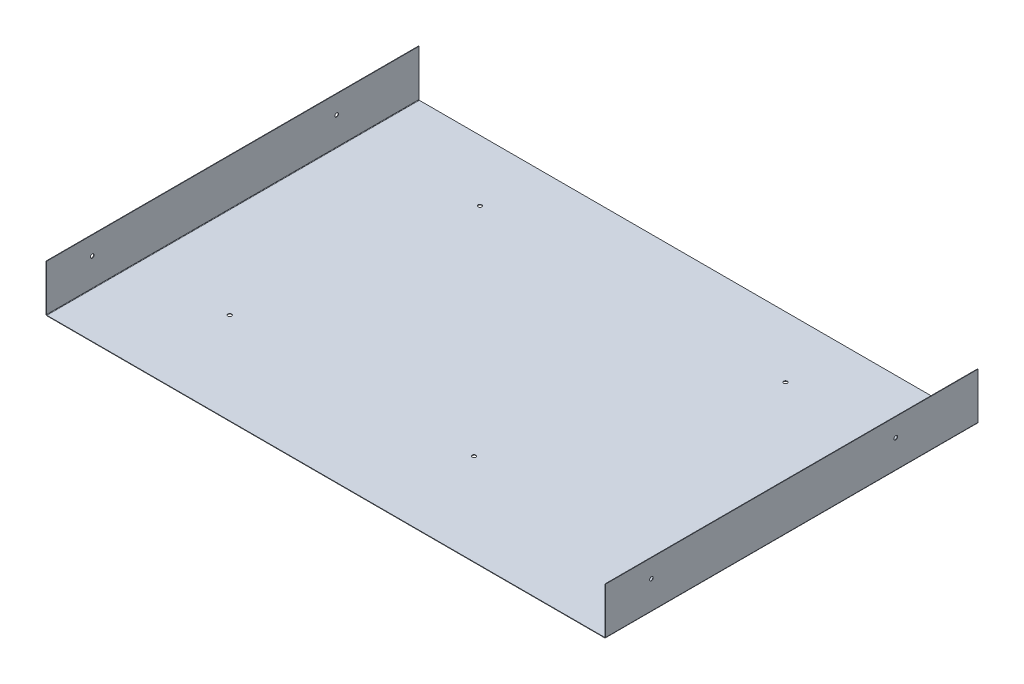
ISO-10303-21;
HEADER;
FILE_DESCRIPTION(('STEP AP214'),'2;1');
FILE_NAME('part.step','',(''),(''),'','','');
FILE_SCHEMA(('AUTOMOTIVE_DESIGN { 1 0 10303 214 1 1 1 1 }'));
ENDSEC;
DATA;
#1=APPLICATION_CONTEXT('core data for automotive mechanical design processes');
#2=APPLICATION_PROTOCOL_DEFINITION('international standard','automotive_design',2000,#1);
#3=PRODUCT_CONTEXT('',#1,'mechanical');
#4=PRODUCT('Part','Part','',(#3));
#5=PRODUCT_RELATED_PRODUCT_CATEGORY('part','',(#4));
#6=PRODUCT_DEFINITION_FORMATION('','',#4);
#7=PRODUCT_DEFINITION_CONTEXT('part definition',#1,'design');
#8=PRODUCT_DEFINITION('design','',#6,#7);
#9=PRODUCT_DEFINITION_SHAPE('','',#8);
#10=(LENGTH_UNIT() NAMED_UNIT(*) SI_UNIT(.MILLI.,.METRE.));
#11=(NAMED_UNIT(*) PLANE_ANGLE_UNIT() SI_UNIT($,.RADIAN.));
#12=(NAMED_UNIT(*) SI_UNIT($,.STERADIAN.) SOLID_ANGLE_UNIT());
#13=UNCERTAINTY_MEASURE_WITH_UNIT(LENGTH_MEASURE(1.E-05),#10,'distance_accuracy_value','');
#14=(GEOMETRIC_REPRESENTATION_CONTEXT(3) GLOBAL_UNCERTAINTY_ASSIGNED_CONTEXT((#13)) GLOBAL_UNIT_ASSIGNED_CONTEXT((#10,
#11,#12)) REPRESENTATION_CONTEXT('',''));
#15=CARTESIAN_POINT('',(0.,0.,0.));
#16=DIRECTION('',(0.,0.,1.));
#17=DIRECTION('',(1.,0.,0.));
#18=AXIS2_PLACEMENT_3D('',#15,#16,#17);
#19=CARTESIAN_POINT('',(0.7366,0.,609.6));
#20=DIRECTION('',(0.,0.,1.));
#21=DIRECTION('',(1.,0.,0.));
#22=AXIS2_PLACEMENT_3D('',#19,#20,#21);
#23=PLANE('',#22);
#24=DIRECTION('',(0.,-1.,0.));
#25=VECTOR('',#24,1.);
#26=CARTESIAN_POINT('',(0.7366,0.,609.6));
#27=LINE('',#26,#25);
#28=CARTESIAN_POINT('',(0.7366,0.,609.6));
#29=VERTEX_POINT('',#28);
#30=CARTESIAN_POINT('',(0.7366,-0.7366,609.6));
#31=VERTEX_POINT('',#30);
#32=EDGE_CURVE('E11',#29,#31,#27,.T.);
#33=ORIENTED_EDGE('',*,*,#32,.F.);
#34=CARTESIAN_POINT('',(0.7366,0.7366,609.6));
#35=DIRECTION('',(0.,0.,-1.));
#36=DIRECTION('',(-1.,0.,0.));
#37=AXIS2_PLACEMENT_3D('',#34,#35,#36);
#38=CIRCLE('',#37,0.7366);
#39=CARTESIAN_POINT('',(0.,0.736599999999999,609.6));
#40=VERTEX_POINT('',#39);
#41=EDGE_CURVE('E245',#40,#29,#38,.F.);
#42=ORIENTED_EDGE('',*,*,#41,.F.);
#43=DIRECTION('',(1.,0.,0.));
#44=VECTOR('',#43,1.);
#45=CARTESIAN_POINT('',(-0.7366,0.736599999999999,609.6));
#46=LINE('',#45,#44);
#47=CARTESIAN_POINT('',(-0.7366,0.736599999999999,609.6));
#48=VERTEX_POINT('',#47);
#49=EDGE_CURVE('E42',#48,#40,#46,.T.);
#50=ORIENTED_EDGE('',*,*,#49,.F.);
#51=CARTESIAN_POINT('',(0.7366,0.7366,609.6));
#52=DIRECTION('',(0.,0.,1.));
#53=DIRECTION('',(1.,0.,0.));
#54=AXIS2_PLACEMENT_3D('',#51,#52,#53);
#55=CIRCLE('',#54,1.4732);
#56=EDGE_CURVE('E143',#48,#31,#55,.T.);
#57=ORIENTED_EDGE('',*,*,#56,.T.);
#58=EDGE_LOOP('',(#33,#42,#50,#57));
#59=FACE_BOUND('',#58,.T.);
#60=ADVANCED_FACE('F34',(#59),#23,.T.);
#61=CARTESIAN_POINT('',(-0.7366,0.736599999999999,609.6));
#62=DIRECTION('',(0.,0.,1.));
#63=DIRECTION('',(1.,0.,0.));
#64=AXIS2_PLACEMENT_3D('',#61,#62,#63);
#65=PLANE('',#64);
#66=DIRECTION('',(1.,0.,0.));
#67=VECTOR('',#66,1.);
#68=CARTESIAN_POINT('',(0.,0.,609.6));
#69=LINE('',#68,#67);
#70=CARTESIAN_POINT('',(913.6634,0.,609.6));
#71=VERTEX_POINT('',#70);
#72=EDGE_CURVE('E137',#29,#71,#69,.T.);
#73=ORIENTED_EDGE('',*,*,#72,.F.);
#74=ORIENTED_EDGE('',*,*,#32,.T.);
#75=DIRECTION('',(1.,0.,0.));
#76=VECTOR('',#75,1.);
#77=CARTESIAN_POINT('',(0.,-0.7366,609.6));
#78=LINE('',#77,#76);
#79=CARTESIAN_POINT('',(913.6634,-0.7366,609.6));
#80=VERTEX_POINT('',#79);
#81=EDGE_CURVE('E134',#31,#80,#78,.T.);
#82=ORIENTED_EDGE('',*,*,#81,.T.);
#83=DIRECTION('',(0.,1.,0.));
#84=VECTOR('',#83,1.);
#85=CARTESIAN_POINT('',(913.6634,-0.7366,609.6));
#86=LINE('',#85,#84);
#87=EDGE_CURVE('E226',#80,#71,#86,.T.);
#88=ORIENTED_EDGE('',*,*,#87,.T.);
#89=EDGE_LOOP('',(#73,#74,#82,#88));
#90=FACE_BOUND('',#89,.T.);
#91=ADVANCED_FACE('F132',(#90),#65,.T.);
#92=CARTESIAN_POINT('',(0.,0.736599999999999,0.));
#93=DIRECTION('',(0.,0.,-1.));
#94=DIRECTION('',(-1.,0.,0.));
#95=AXIS2_PLACEMENT_3D('',#92,#93,#94);
#96=PLANE('',#95);
#97=DIRECTION('',(-1.,0.,0.));
#98=VECTOR('',#97,1.);
#99=CARTESIAN_POINT('',(0.,0.736599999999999,0.));
#100=LINE('',#99,#98);
#101=CARTESIAN_POINT('',(0.,0.736599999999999,0.));
#102=VERTEX_POINT('',#101);
#103=CARTESIAN_POINT('',(-0.7366,0.736599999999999,0.));
#104=VERTEX_POINT('',#103);
#105=EDGE_CURVE('E231',#102,#104,#100,.T.);
#106=ORIENTED_EDGE('',*,*,#105,.F.);
#107=CARTESIAN_POINT('',(0.7366,0.7366,0.));
#108=DIRECTION('',(0.,0.,-1.));
#109=DIRECTION('',(-1.,0.,0.));
#110=AXIS2_PLACEMENT_3D('',#107,#108,#109);
#111=CIRCLE('',#110,0.7366);
#112=CARTESIAN_POINT('',(0.7366,0.,0.));
#113=VERTEX_POINT('',#112);
#114=EDGE_CURVE('E183',#102,#113,#111,.F.);
#115=ORIENTED_EDGE('',*,*,#114,.T.);
#116=DIRECTION('',(0.,1.,0.));
#117=VECTOR('',#116,1.);
#118=CARTESIAN_POINT('',(0.7366,-0.7366,0.));
#119=LINE('',#118,#117);
#120=CARTESIAN_POINT('',(0.7366,-0.7366,0.));
#121=VERTEX_POINT('',#120);
#122=EDGE_CURVE('E229',#121,#113,#119,.T.);
#123=ORIENTED_EDGE('',*,*,#122,.F.);
#124=CARTESIAN_POINT('',(0.7366,0.7366,0.));
#125=DIRECTION('',(0.,0.,1.));
#126=DIRECTION('',(1.,0.,0.));
#127=AXIS2_PLACEMENT_3D('',#124,#125,#126);
#128=CIRCLE('',#127,1.4732);
#129=EDGE_CURVE('E155',#104,#121,#128,.T.);
#130=ORIENTED_EDGE('',*,*,#129,.F.);
#131=EDGE_LOOP('',(#106,#115,#123,#130));
#132=FACE_BOUND('',#131,.T.);
#133=ADVANCED_FACE('F345',(#132),#96,.T.);
#134=CARTESIAN_POINT('',(0.7366,-0.7366,0.));
#135=DIRECTION('',(0.,0.,-1.));
#136=DIRECTION('',(-1.,0.,0.));
#137=AXIS2_PLACEMENT_3D('',#134,#135,#136);
#138=PLANE('',#137);
#139=DIRECTION('',(0.,-1.,0.));
#140=VECTOR('',#139,1.);
#141=CARTESIAN_POINT('',(0.,0.,0.));
#142=LINE('',#141,#140);
#143=CARTESIAN_POINT('',(0.,76.2,0.));
#144=VERTEX_POINT('',#143);
#145=EDGE_CURVE('E186',#144,#102,#142,.T.);
#146=ORIENTED_EDGE('',*,*,#145,.T.);
#147=ORIENTED_EDGE('',*,*,#105,.T.);
#148=DIRECTION('',(0.,1.,0.));
#149=VECTOR('',#148,1.);
#150=CARTESIAN_POINT('',(-0.7366,0.,0.));
#151=LINE('',#150,#149);
#152=CARTESIAN_POINT('',(-0.7366,76.2,0.));
#153=VERTEX_POINT('',#152);
#154=EDGE_CURVE('E192',#153,#104,#151,.F.);
#155=ORIENTED_EDGE('',*,*,#154,.F.);
#156=DIRECTION('',(1.,0.,0.));
#157=VECTOR('',#156,1.);
#158=CARTESIAN_POINT('',(-0.7366,76.2,0.));
#159=LINE('',#158,#157);
#160=EDGE_CURVE('E189',#153,#144,#159,.T.);
#161=ORIENTED_EDGE('',*,*,#160,.T.);
#162=EDGE_LOOP('',(#146,#147,#155,#161));
#163=FACE_BOUND('',#162,.T.);
#164=ADVANCED_FACE('F348',(#163),#138,.T.);
#165=CARTESIAN_POINT('',(914.4,0.7366,609.6));
#166=DIRECTION('',(0.,0.,1.));
#167=DIRECTION('',(1.,0.,0.));
#168=AXIS2_PLACEMENT_3D('',#165,#166,#167);
#169=PLANE('',#168);
#170=DIRECTION('',(1.,0.,0.));
#171=VECTOR('',#170,1.);
#172=CARTESIAN_POINT('',(914.4,0.7366,609.6));
#173=LINE('',#172,#171);
#174=CARTESIAN_POINT('',(914.4,0.7366,609.6));
#175=VERTEX_POINT('',#174);
#176=CARTESIAN_POINT('',(915.1366,0.7366,609.6));
#177=VERTEX_POINT('',#176);
#178=EDGE_CURVE('E50',#175,#177,#173,.T.);
#179=ORIENTED_EDGE('',*,*,#178,.F.);
#180=CARTESIAN_POINT('',(913.6634,0.7366,609.6));
#181=DIRECTION('',(0.,0.,-1.));
#182=DIRECTION('',(-1.,0.,0.));
#183=AXIS2_PLACEMENT_3D('',#180,#181,#182);
#184=CIRCLE('',#183,0.7366);
#185=EDGE_CURVE('E255',#71,#175,#184,.F.);
#186=ORIENTED_EDGE('',*,*,#185,.F.);
#187=ORIENTED_EDGE('',*,*,#87,.F.);
#188=CARTESIAN_POINT('',(913.6634,0.7366,609.6));
#189=DIRECTION('',(0.,0.,1.));
#190=DIRECTION('',(1.,0.,0.));
#191=AXIS2_PLACEMENT_3D('',#188,#189,#190);
#192=CIRCLE('',#191,1.4732);
#193=EDGE_CURVE('E163',#80,#177,#192,.T.);
#194=ORIENTED_EDGE('',*,*,#193,.T.);
#195=EDGE_LOOP('',(#179,#186,#187,#194));
#196=FACE_BOUND('',#195,.T.);
#197=ADVANCED_FACE('F340',(#196),#169,.T.);
#198=CARTESIAN_POINT('',(913.6634,-0.7366,609.6));
#199=DIRECTION('',(0.,0.,1.));
#200=DIRECTION('',(1.,0.,0.));
#201=AXIS2_PLACEMENT_3D('',#198,#199,#200);
#202=PLANE('',#201);
#203=DIRECTION('',(0.,1.,0.));
#204=VECTOR('',#203,1.);
#205=CARTESIAN_POINT('',(914.4,0.,609.6));
#206=LINE('',#205,#204);
#207=CARTESIAN_POINT('',(914.4,76.2,609.6));
#208=VERTEX_POINT('',#207);
#209=EDGE_CURVE('E258',#175,#208,#206,.T.);
#210=ORIENTED_EDGE('',*,*,#209,.F.);
#211=ORIENTED_EDGE('',*,*,#178,.T.);
#212=DIRECTION('',(0.,1.,0.));
#213=VECTOR('',#212,1.);
#214=CARTESIAN_POINT('',(915.1366,0.,609.6));
#215=LINE('',#214,#213);
#216=CARTESIAN_POINT('',(915.1366,76.2,609.6));
#217=VERTEX_POINT('',#216);
#218=EDGE_CURVE('E104',#177,#217,#215,.T.);
#219=ORIENTED_EDGE('',*,*,#218,.T.);
#220=DIRECTION('',(1.,0.,0.));
#221=VECTOR('',#220,1.);
#222=CARTESIAN_POINT('',(914.4,76.2,609.6));
#223=LINE('',#222,#221);
#224=EDGE_CURVE('E261',#208,#217,#223,.T.);
#225=ORIENTED_EDGE('',*,*,#224,.F.);
#226=EDGE_LOOP('',(#210,#211,#219,#225));
#227=FACE_BOUND('',#226,.T.);
#228=ADVANCED_FACE('F330',(#227),#202,.T.);
#229=CARTESIAN_POINT('',(913.6634,0.,0.));
#230=DIRECTION('',(0.,0.,-1.));
#231=DIRECTION('',(-1.,0.,0.));
#232=AXIS2_PLACEMENT_3D('',#229,#230,#231);
#233=PLANE('',#232);
#234=DIRECTION('',(0.,-1.,0.));
#235=VECTOR('',#234,1.);
#236=CARTESIAN_POINT('',(913.6634,0.,0.));
#237=LINE('',#236,#235);
#238=CARTESIAN_POINT('',(913.6634,0.,0.));
#239=VERTEX_POINT('',#238);
#240=CARTESIAN_POINT('',(913.6634,-0.7366,0.));
#241=VERTEX_POINT('',#240);
#242=EDGE_CURVE('E91',#239,#241,#237,.T.);
#243=ORIENTED_EDGE('',*,*,#242,.F.);
#244=CARTESIAN_POINT('',(913.6634,0.7366,0.));
#245=DIRECTION('',(0.,0.,-1.));
#246=DIRECTION('',(-1.,0.,0.));
#247=AXIS2_PLACEMENT_3D('',#244,#245,#246);
#248=CIRCLE('',#247,0.7366);
#249=CARTESIAN_POINT('',(914.4,0.7366,0.));
#250=VERTEX_POINT('',#249);
#251=EDGE_CURVE('E179',#239,#250,#248,.F.);
#252=ORIENTED_EDGE('',*,*,#251,.T.);
#253=DIRECTION('',(-1.,0.,0.));
#254=VECTOR('',#253,1.);
#255=CARTESIAN_POINT('',(915.1366,0.7366,0.));
#256=LINE('',#255,#254);
#257=CARTESIAN_POINT('',(915.1366,0.7366,0.));
#258=VERTEX_POINT('',#257);
#259=EDGE_CURVE('E98',#258,#250,#256,.T.);
#260=ORIENTED_EDGE('',*,*,#259,.F.);
#261=CARTESIAN_POINT('',(913.6634,0.7366,0.));
#262=DIRECTION('',(0.,0.,1.));
#263=DIRECTION('',(1.,0.,0.));
#264=AXIS2_PLACEMENT_3D('',#261,#262,#263);
#265=CIRCLE('',#264,1.4732);
#266=EDGE_CURVE('E198',#241,#258,#265,.T.);
#267=ORIENTED_EDGE('',*,*,#266,.F.);
#268=EDGE_LOOP('',(#243,#252,#260,#267));
#269=FACE_BOUND('',#268,.T.);
#270=ADVANCED_FACE('F379',(#269),#233,.T.);
#271=CARTESIAN_POINT('',(915.1366,0.7366,0.));
#272=DIRECTION('',(0.,0.,-1.));
#273=DIRECTION('',(-1.,0.,0.));
#274=AXIS2_PLACEMENT_3D('',#271,#272,#273);
#275=PLANE('',#274);
#276=DIRECTION('',(1.,0.,0.));
#277=VECTOR('',#276,1.);
#278=CARTESIAN_POINT('',(0.,0.,0.));
#279=LINE('',#278,#277);
#280=EDGE_CURVE('E181',#113,#239,#279,.T.);
#281=ORIENTED_EDGE('',*,*,#280,.T.);
#282=ORIENTED_EDGE('',*,*,#242,.T.);
#283=DIRECTION('',(1.,0.,0.));
#284=VECTOR('',#283,1.);
#285=CARTESIAN_POINT('',(0.,-0.7366,0.));
#286=LINE('',#285,#284);
#287=EDGE_CURVE('E196',#121,#241,#286,.T.);
#288=ORIENTED_EDGE('',*,*,#287,.F.);
#289=ORIENTED_EDGE('',*,*,#122,.T.);
#290=EDGE_LOOP('',(#281,#282,#288,#289));
#291=FACE_BOUND('',#290,.T.);
#292=ADVANCED_FACE('F319',(#291),#275,.T.);
#293=CARTESIAN_POINT('',(915.1366,0.,609.6));
#294=DIRECTION('',(-1.,0.,0.));
#295=DIRECTION('',(0.,0.,1.));
#296=AXIS2_PLACEMENT_3D('',#293,#294,#295);
#297=PLANE('',#296);
#298=CARTESIAN_POINT('',(915.1366,46.2,134.6));
#299=DIRECTION('',(1.,0.,0.));
#300=DIRECTION('',(0.,0.,-1.));
#301=AXIS2_PLACEMENT_3D('',#298,#299,#300);
#302=CIRCLE('',#301,2.99999999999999);
#303=CARTESIAN_POINT('',(915.1366,46.2,131.6));
#304=VERTEX_POINT('',#303);
#305=EDGE_CURVE('E309',#304,#304,#302,.T.);
#306=ORIENTED_EDGE('',*,*,#305,.F.);
#307=EDGE_LOOP('',(#306));
#308=FACE_BOUND('',#307,.T.);
#309=CARTESIAN_POINT('',(915.1366,46.2,534.6));
#310=DIRECTION('',(1.,0.,0.));
#311=DIRECTION('',(0.,0.,-1.));
#312=AXIS2_PLACEMENT_3D('',#309,#310,#311);
#313=CIRCLE('',#312,2.99999999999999);
#314=CARTESIAN_POINT('',(915.1366,46.2,531.6));
#315=VERTEX_POINT('',#314);
#316=EDGE_CURVE('E297',#315,#315,#313,.T.);
#317=ORIENTED_EDGE('',*,*,#316,.F.);
#318=EDGE_LOOP('',(#317));
#319=FACE_BOUND('',#318,.T.);
#320=DIRECTION('',(0.,1.,0.));
#321=VECTOR('',#320,1.);
#322=CARTESIAN_POINT('',(915.1366,0.,0.));
#323=LINE('',#322,#321);
#324=CARTESIAN_POINT('',(915.1366,76.2,0.));
#325=VERTEX_POINT('',#324);
#326=EDGE_CURVE('E169',#258,#325,#323,.T.);
#327=ORIENTED_EDGE('',*,*,#326,.T.);
#328=DIRECTION('',(0.,0.,-1.));
#329=VECTOR('',#328,1.);
#330=CARTESIAN_POINT('',(915.1366,76.2,609.6));
#331=LINE('',#330,#329);
#332=EDGE_CURVE('E222',#217,#325,#331,.T.);
#333=ORIENTED_EDGE('',*,*,#332,.F.);
#334=ORIENTED_EDGE('',*,*,#218,.F.);
#335=DIRECTION('',(0.,0.,-1.));
#336=VECTOR('',#335,1.);
#337=CARTESIAN_POINT('',(915.1366,0.7366,609.6));
#338=LINE('',#337,#336);
#339=EDGE_CURVE('E165',#177,#258,#338,.T.);
#340=ORIENTED_EDGE('',*,*,#339,.T.);
#341=EDGE_LOOP('',(#327,#333,#334,#340));
#342=FACE_BOUND('',#341,.T.);
#343=ADVANCED_FACE('F315',(#308,#319,#342),#297,.F.);
#344=CARTESIAN_POINT('',(914.4,76.2,609.6));
#345=DIRECTION('',(0.,1.,0.));
#346=DIRECTION('',(0.,0.,1.));
#347=AXIS2_PLACEMENT_3D('',#344,#345,#346);
#348=PLANE('',#347);
#349=DIRECTION('',(1.,0.,0.));
#350=VECTOR('',#349,1.);
#351=CARTESIAN_POINT('',(914.4,76.2,0.));
#352=LINE('',#351,#350);
#353=CARTESIAN_POINT('',(914.4,76.2,0.));
#354=VERTEX_POINT('',#353);
#355=EDGE_CURVE('E172',#354,#325,#352,.T.);
#356=ORIENTED_EDGE('',*,*,#355,.F.);
#357=DIRECTION('',(0.,0.,-1.));
#358=VECTOR('',#357,1.);
#359=CARTESIAN_POINT('',(914.4,76.2,609.6));
#360=LINE('',#359,#358);
#361=EDGE_CURVE('E220',#208,#354,#360,.T.);
#362=ORIENTED_EDGE('',*,*,#361,.F.);
#363=ORIENTED_EDGE('',*,*,#224,.T.);
#364=ORIENTED_EDGE('',*,*,#332,.T.);
#365=EDGE_LOOP('',(#356,#362,#363,#364));
#366=FACE_BOUND('',#365,.T.);
#367=ADVANCED_FACE('F318',(#366),#348,.T.);
#368=CARTESIAN_POINT('',(914.4,0.,609.6));
#369=DIRECTION('',(-1.,0.,0.));
#370=DIRECTION('',(0.,0.,1.));
#371=AXIS2_PLACEMENT_3D('',#368,#369,#370);
#372=PLANE('',#371);
#373=CARTESIAN_POINT('',(914.4,46.2,134.6));
#374=DIRECTION('',(-1.,0.,0.));
#375=DIRECTION('',(0.,0.,1.));
#376=AXIS2_PLACEMENT_3D('',#373,#374,#375);
#377=CIRCLE('',#376,2.99999999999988);
#378=CARTESIAN_POINT('',(914.4,46.2,137.6));
#379=VERTEX_POINT('',#378);
#380=EDGE_CURVE('E300',#379,#379,#377,.T.);
#381=ORIENTED_EDGE('',*,*,#380,.F.);
#382=EDGE_LOOP('',(#381));
#383=FACE_BOUND('',#382,.T.);
#384=CARTESIAN_POINT('',(914.4,46.2,534.6));
#385=DIRECTION('',(-1.,0.,0.));
#386=DIRECTION('',(0.,0.,1.));
#387=AXIS2_PLACEMENT_3D('',#384,#385,#386);
#388=CIRCLE('',#387,2.99999999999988);
#389=CARTESIAN_POINT('',(914.4,46.2,537.6));
#390=VERTEX_POINT('',#389);
#391=EDGE_CURVE('E288',#390,#390,#388,.T.);
#392=ORIENTED_EDGE('',*,*,#391,.F.);
#393=EDGE_LOOP('',(#392));
#394=FACE_BOUND('',#393,.T.);
#395=DIRECTION('',(0.,1.,0.));
#396=VECTOR('',#395,1.);
#397=CARTESIAN_POINT('',(914.4,0.,0.));
#398=LINE('',#397,#396);
#399=EDGE_CURVE('E176',#250,#354,#398,.T.);
#400=ORIENTED_EDGE('',*,*,#399,.F.);
#401=DIRECTION('',(0.,0.,-1.));
#402=VECTOR('',#401,1.);
#403=CARTESIAN_POINT('',(914.4,0.7366,609.6));
#404=LINE('',#403,#402);
#405=EDGE_CURVE('E217',#175,#250,#404,.T.);
#406=ORIENTED_EDGE('',*,*,#405,.F.);
#407=ORIENTED_EDGE('',*,*,#209,.T.);
#408=ORIENTED_EDGE('',*,*,#361,.T.);
#409=EDGE_LOOP('',(#400,#406,#407,#408));
#410=FACE_BOUND('',#409,.T.);
#411=ADVANCED_FACE('F333',(#383,#394,#410),#372,.T.);
#412=CARTESIAN_POINT('',(913.6634,0.7366,609.6));
#413=DIRECTION('',(0.,0.,-1.));
#414=DIRECTION('',(-1.,0.,0.));
#415=AXIS2_PLACEMENT_3D('',#412,#413,#414);
#416=CYLINDRICAL_SURFACE('',#415,0.7366);
#417=ORIENTED_EDGE('',*,*,#251,.F.);
#418=DIRECTION('',(0.,0.,-1.));
#419=VECTOR('',#418,1.);
#420=CARTESIAN_POINT('',(913.6634,0.,609.6));
#421=LINE('',#420,#419);
#422=EDGE_CURVE('E214',#71,#239,#421,.T.);
#423=ORIENTED_EDGE('',*,*,#422,.F.);
#424=ORIENTED_EDGE('',*,*,#185,.T.);
#425=ORIENTED_EDGE('',*,*,#405,.T.);
#426=EDGE_LOOP('',(#417,#423,#424,#425));
#427=FACE_BOUND('',#426,.T.);
#428=ADVANCED_FACE('F336',(#427),#416,.F.);
#429=CARTESIAN_POINT('',(0.,0.,609.6));
#430=DIRECTION('',(0.,1.,0.));
#431=DIRECTION('',(0.,0.,1.));
#432=AXIS2_PLACEMENT_3D('',#429,#430,#431);
#433=PLANE('',#432);
#434=CARTESIAN_POINT('',(200.,0.,100.));
#435=DIRECTION('',(0.,1.,0.));
#436=DIRECTION('',(0.,0.,1.));
#437=AXIS2_PLACEMENT_3D('',#434,#435,#436);
#438=CIRCLE('',#437,3.);
#439=CARTESIAN_POINT('',(200.,0.,103.));
#440=VERTEX_POINT('',#439);
#441=EDGE_CURVE('E285',#440,#440,#438,.T.);
#442=ORIENTED_EDGE('',*,*,#441,.F.);
#443=EDGE_LOOP('',(#442));
#444=FACE_BOUND('',#443,.T.);
#445=CARTESIAN_POINT('',(150.,0.,459.6));
#446=DIRECTION('',(0.,1.,0.));
#447=DIRECTION('',(0.,0.,1.));
#448=AXIS2_PLACEMENT_3D('',#445,#446,#447);
#449=CIRCLE('',#448,3.);
#450=CARTESIAN_POINT('',(150.,0.,462.6));
#451=VERTEX_POINT('',#450);
#452=EDGE_CURVE('E279',#451,#451,#449,.T.);
#453=ORIENTED_EDGE('',*,*,#452,.F.);
#454=EDGE_LOOP('',(#453));
#455=FACE_BOUND('',#454,.T.);
#456=CARTESIAN_POINT('',(550.,0.,459.6));
#457=DIRECTION('',(0.,1.,0.));
#458=DIRECTION('',(0.,0.,1.));
#459=AXIS2_PLACEMENT_3D('',#456,#457,#458);
#460=CIRCLE('',#459,3.);
#461=CARTESIAN_POINT('',(550.,0.,462.6));
#462=VERTEX_POINT('',#461);
#463=EDGE_CURVE('E273',#462,#462,#460,.T.);
#464=ORIENTED_EDGE('',*,*,#463,.F.);
#465=EDGE_LOOP('',(#464));
#466=FACE_BOUND('',#465,.T.);
#467=CARTESIAN_POINT('',(700.,0.,100.));
#468=DIRECTION('',(0.,1.,0.));
#469=DIRECTION('',(0.,0.,1.));
#470=AXIS2_PLACEMENT_3D('',#467,#468,#469);
#471=CIRCLE('',#470,3.);
#472=CARTESIAN_POINT('',(700.,0.,103.));
#473=VERTEX_POINT('',#472);
#474=EDGE_CURVE('E267',#473,#473,#471,.T.);
#475=ORIENTED_EDGE('',*,*,#474,.F.);
#476=EDGE_LOOP('',(#475));
#477=FACE_BOUND('',#476,.T.);
#478=ORIENTED_EDGE('',*,*,#280,.F.);
#479=DIRECTION('',(0.,0.,-1.));
#480=VECTOR('',#479,1.);
#481=CARTESIAN_POINT('',(0.7366,0.,609.6));
#482=LINE('',#481,#480);
#483=EDGE_CURVE('E211',#29,#113,#482,.T.);
#484=ORIENTED_EDGE('',*,*,#483,.F.);
#485=ORIENTED_EDGE('',*,*,#72,.T.);
#486=ORIENTED_EDGE('',*,*,#422,.T.);
#487=EDGE_LOOP('',(#478,#484,#485,#486));
#488=FACE_BOUND('',#487,.T.);
#489=ADVANCED_FACE('F343',(#444,#455,#466,#477,#488),#433,.T.);
#490=CARTESIAN_POINT('',(0.7366,0.7366,609.6));
#491=DIRECTION('',(0.,0.,-1.));
#492=DIRECTION('',(-1.,0.,0.));
#493=AXIS2_PLACEMENT_3D('',#490,#491,#492);
#494=CYLINDRICAL_SURFACE('',#493,0.7366);
#495=ORIENTED_EDGE('',*,*,#114,.F.);
#496=DIRECTION('',(0.,0.,-1.));
#497=VECTOR('',#496,1.);
#498=CARTESIAN_POINT('',(0.,0.736599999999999,609.6));
#499=LINE('',#498,#497);
#500=EDGE_CURVE('E208',#40,#102,#499,.T.);
#501=ORIENTED_EDGE('',*,*,#500,.F.);
#502=ORIENTED_EDGE('',*,*,#41,.T.);
#503=ORIENTED_EDGE('',*,*,#483,.T.);
#504=EDGE_LOOP('',(#495,#501,#502,#503));
#505=FACE_BOUND('',#504,.T.);
#506=ADVANCED_FACE('F244',(#505),#494,.F.);
#507=CARTESIAN_POINT('',(0.,0.,609.6));
#508=DIRECTION('',(1.,0.,0.));
#509=DIRECTION('',(0.,0.,-1.));
#510=AXIS2_PLACEMENT_3D('',#507,#508,#509);
#511=PLANE('',#510);
#512=CARTESIAN_POINT('',(0.,46.2,134.6));
#513=DIRECTION('',(1.,0.,0.));
#514=DIRECTION('',(0.,0.,-1.));
#515=AXIS2_PLACEMENT_3D('',#512,#513,#514);
#516=CIRCLE('',#515,2.99999999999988);
#517=CARTESIAN_POINT('',(0.,46.2,131.6));
#518=VERTEX_POINT('',#517);
#519=EDGE_CURVE('E303',#518,#518,#516,.T.);
#520=ORIENTED_EDGE('',*,*,#519,.F.);
#521=EDGE_LOOP('',(#520));
#522=FACE_BOUND('',#521,.T.);
#523=CARTESIAN_POINT('',(0.,46.2,534.6));
#524=DIRECTION('',(1.,0.,0.));
#525=DIRECTION('',(0.,0.,-1.));
#526=AXIS2_PLACEMENT_3D('',#523,#524,#525);
#527=CIRCLE('',#526,2.99999999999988);
#528=CARTESIAN_POINT('',(0.,46.2,531.6));
#529=VERTEX_POINT('',#528);
#530=EDGE_CURVE('E291',#529,#529,#527,.T.);
#531=ORIENTED_EDGE('',*,*,#530,.F.);
#532=EDGE_LOOP('',(#531));
#533=FACE_BOUND('',#532,.T.);
#534=ORIENTED_EDGE('',*,*,#145,.F.);
#535=DIRECTION('',(0.,0.,-1.));
#536=VECTOR('',#535,1.);
#537=CARTESIAN_POINT('',(0.,76.2,609.6));
#538=LINE('',#537,#536);
#539=CARTESIAN_POINT('',(0.,76.2,609.6));
#540=VERTEX_POINT('',#539);
#541=EDGE_CURVE('E206',#540,#144,#538,.T.);
#542=ORIENTED_EDGE('',*,*,#541,.F.);
#543=DIRECTION('',(0.,-1.,0.));
#544=VECTOR('',#543,1.);
#545=CARTESIAN_POINT('',(0.,0.,609.6));
#546=LINE('',#545,#544);
#547=EDGE_CURVE('E238',#540,#40,#546,.T.);
#548=ORIENTED_EDGE('',*,*,#547,.T.);
#549=ORIENTED_EDGE('',*,*,#500,.T.);
#550=EDGE_LOOP('',(#534,#542,#548,#549));
#551=FACE_BOUND('',#550,.T.);
#552=ADVANCED_FACE('F249',(#522,#533,#551),#511,.T.);
#553=CARTESIAN_POINT('',(-0.7366,76.2,609.6));
#554=DIRECTION('',(0.,1.,0.));
#555=DIRECTION('',(0.,0.,1.));
#556=AXIS2_PLACEMENT_3D('',#553,#554,#555);
#557=PLANE('',#556);
#558=ORIENTED_EDGE('',*,*,#160,.F.);
#559=DIRECTION('',(0.,0.,-1.));
#560=VECTOR('',#559,1.);
#561=CARTESIAN_POINT('',(-0.7366,76.2,609.6));
#562=LINE('',#561,#560);
#563=CARTESIAN_POINT('',(-0.7366,76.2,609.6));
#564=VERTEX_POINT('',#563);
#565=EDGE_CURVE('E204',#564,#153,#562,.T.);
#566=ORIENTED_EDGE('',*,*,#565,.F.);
#567=DIRECTION('',(1.,0.,0.));
#568=VECTOR('',#567,1.);
#569=CARTESIAN_POINT('',(-0.7366,76.2,609.6));
#570=LINE('',#569,#568);
#571=EDGE_CURVE('E250',#564,#540,#570,.T.);
#572=ORIENTED_EDGE('',*,*,#571,.T.);
#573=ORIENTED_EDGE('',*,*,#541,.T.);
#574=EDGE_LOOP('',(#558,#566,#572,#573));
#575=FACE_BOUND('',#574,.T.);
#576=ADVANCED_FACE('F353',(#575),#557,.T.);
#577=CARTESIAN_POINT('',(-0.7366,0.,609.6));
#578=DIRECTION('',(1.,0.,0.));
#579=DIRECTION('',(0.,0.,-1.));
#580=AXIS2_PLACEMENT_3D('',#577,#578,#579);
#581=PLANE('',#580);
#582=CARTESIAN_POINT('',(-0.736599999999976,46.2,134.6));
#583=DIRECTION('',(1.,0.,0.));
#584=DIRECTION('',(0.,0.,-1.));
#585=AXIS2_PLACEMENT_3D('',#582,#583,#584);
#586=CIRCLE('',#585,2.99999999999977);
#587=CARTESIAN_POINT('',(-0.736599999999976,46.2,131.6));
#588=VERTEX_POINT('',#587);
#589=EDGE_CURVE('E306',#588,#588,#586,.T.);
#590=ORIENTED_EDGE('',*,*,#589,.T.);
#591=EDGE_LOOP('',(#590));
#592=FACE_BOUND('',#591,.T.);
#593=CARTESIAN_POINT('',(-0.736599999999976,46.2,534.6));
#594=DIRECTION('',(1.,0.,0.));
#595=DIRECTION('',(0.,0.,-1.));
#596=AXIS2_PLACEMENT_3D('',#593,#594,#595);
#597=CIRCLE('',#596,2.99999999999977);
#598=CARTESIAN_POINT('',(-0.736599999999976,46.2,531.6));
#599=VERTEX_POINT('',#598);
#600=EDGE_CURVE('E294',#599,#599,#597,.T.);
#601=ORIENTED_EDGE('',*,*,#600,.T.);
#602=EDGE_LOOP('',(#601));
#603=FACE_BOUND('',#602,.T.);
#604=ORIENTED_EDGE('',*,*,#154,.T.);
#605=DIRECTION('',(0.,0.,-1.));
#606=VECTOR('',#605,1.);
#607=CARTESIAN_POINT('',(-0.7366,0.736599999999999,609.6));
#608=LINE('',#607,#606);
#609=EDGE_CURVE('E157',#48,#104,#608,.T.);
#610=ORIENTED_EDGE('',*,*,#609,.F.);
#611=DIRECTION('',(0.,1.,0.));
#612=VECTOR('',#611,1.);
#613=CARTESIAN_POINT('',(-0.7366,0.,609.6));
#614=LINE('',#613,#612);
#615=EDGE_CURVE('E148',#564,#48,#614,.F.);
#616=ORIENTED_EDGE('',*,*,#615,.F.);
#617=ORIENTED_EDGE('',*,*,#565,.T.);
#618=EDGE_LOOP('',(#604,#610,#616,#617));
#619=FACE_BOUND('',#618,.T.);
#620=ADVANCED_FACE('F351',(#592,#603,#619),#581,.F.);
#621=CARTESIAN_POINT('',(0.7366,0.7366,609.6));
#622=DIRECTION('',(0.,0.,-1.));
#623=DIRECTION('',(-1.,0.,0.));
#624=AXIS2_PLACEMENT_3D('',#621,#622,#623);
#625=CYLINDRICAL_SURFACE('',#624,1.4732);
#626=ORIENTED_EDGE('',*,*,#129,.T.);
#627=DIRECTION('',(0.,0.,-1.));
#628=VECTOR('',#627,1.);
#629=CARTESIAN_POINT('',(0.7366,-0.7366,609.6));
#630=LINE('',#629,#628);
#631=EDGE_CURVE('E152',#31,#121,#630,.T.);
#632=ORIENTED_EDGE('',*,*,#631,.F.);
#633=ORIENTED_EDGE('',*,*,#56,.F.);
#634=ORIENTED_EDGE('',*,*,#609,.T.);
#635=EDGE_LOOP('',(#626,#632,#633,#634));
#636=FACE_BOUND('',#635,.T.);
#637=ADVANCED_FACE('F153',(#636),#625,.T.);
#638=CARTESIAN_POINT('',(0.,-0.7366,609.6));
#639=DIRECTION('',(0.,1.,0.));
#640=DIRECTION('',(0.,0.,1.));
#641=AXIS2_PLACEMENT_3D('',#638,#639,#640);
#642=PLANE('',#641);
#643=CARTESIAN_POINT('',(200.,-0.7366,100.));
#644=DIRECTION('',(0.,1.,0.));
#645=DIRECTION('',(0.,0.,1.));
#646=AXIS2_PLACEMENT_3D('',#643,#644,#645);
#647=CIRCLE('',#646,3.);
#648=CARTESIAN_POINT('',(200.,-0.7366,103.));
#649=VERTEX_POINT('',#648);
#650=EDGE_CURVE('E282',#649,#649,#647,.T.);
#651=ORIENTED_EDGE('',*,*,#650,.T.);
#652=EDGE_LOOP('',(#651));
#653=FACE_BOUND('',#652,.T.);
#654=CARTESIAN_POINT('',(150.,-0.7366,459.6));
#655=DIRECTION('',(0.,1.,0.));
#656=DIRECTION('',(0.,0.,1.));
#657=AXIS2_PLACEMENT_3D('',#654,#655,#656);
#658=CIRCLE('',#657,3.);
#659=CARTESIAN_POINT('',(150.,-0.7366,462.6));
#660=VERTEX_POINT('',#659);
#661=EDGE_CURVE('E276',#660,#660,#658,.T.);
#662=ORIENTED_EDGE('',*,*,#661,.T.);
#663=EDGE_LOOP('',(#662));
#664=FACE_BOUND('',#663,.T.);
#665=CARTESIAN_POINT('',(550.,-0.7366,459.6));
#666=DIRECTION('',(0.,1.,0.));
#667=DIRECTION('',(0.,0.,1.));
#668=AXIS2_PLACEMENT_3D('',#665,#666,#667);
#669=CIRCLE('',#668,3.);
#670=CARTESIAN_POINT('',(550.,-0.7366,462.6));
#671=VERTEX_POINT('',#670);
#672=EDGE_CURVE('E270',#671,#671,#669,.T.);
#673=ORIENTED_EDGE('',*,*,#672,.T.);
#674=EDGE_LOOP('',(#673));
#675=FACE_BOUND('',#674,.T.);
#676=CARTESIAN_POINT('',(700.,-0.7366,100.));
#677=DIRECTION('',(0.,1.,0.));
#678=DIRECTION('',(0.,0.,1.));
#679=AXIS2_PLACEMENT_3D('',#676,#677,#678);
#680=CIRCLE('',#679,3.);
#681=CARTESIAN_POINT('',(700.,-0.7366,103.));
#682=VERTEX_POINT('',#681);
#683=EDGE_CURVE('E173',#682,#682,#680,.T.);
#684=ORIENTED_EDGE('',*,*,#683,.T.);
#685=EDGE_LOOP('',(#684));
#686=FACE_BOUND('',#685,.T.);
#687=ORIENTED_EDGE('',*,*,#287,.T.);
#688=DIRECTION('',(0.,0.,-1.));
#689=VECTOR('',#688,1.);
#690=CARTESIAN_POINT('',(913.6634,-0.7366,609.6));
#691=LINE('',#690,#689);
#692=EDGE_CURVE('E158',#80,#241,#691,.T.);
#693=ORIENTED_EDGE('',*,*,#692,.F.);
#694=ORIENTED_EDGE('',*,*,#81,.F.);
#695=ORIENTED_EDGE('',*,*,#631,.T.);
#696=EDGE_LOOP('',(#687,#693,#694,#695));
#697=FACE_BOUND('',#696,.T.);
#698=ADVANCED_FACE('F160',(#653,#664,#675,#686,#697),#642,.F.);
#699=CARTESIAN_POINT('',(913.6634,0.7366,609.6));
#700=DIRECTION('',(0.,0.,-1.));
#701=DIRECTION('',(-1.,0.,0.));
#702=AXIS2_PLACEMENT_3D('',#699,#700,#701);
#703=CYLINDRICAL_SURFACE('',#702,1.4732);
#704=ORIENTED_EDGE('',*,*,#266,.T.);
#705=ORIENTED_EDGE('',*,*,#339,.F.);
#706=ORIENTED_EDGE('',*,*,#193,.F.);
#707=ORIENTED_EDGE('',*,*,#692,.T.);
#708=EDGE_LOOP('',(#704,#705,#706,#707));
#709=FACE_BOUND('',#708,.T.);
#710=ADVANCED_FACE('F480',(#709),#703,.T.);
#711=CARTESIAN_POINT('',(913.6634,0.7366,609.6));
#712=DIRECTION('',(0.,0.,-1.));
#713=DIRECTION('',(-1.,0.,0.));
#714=AXIS2_PLACEMENT_3D('',#711,#712,#713);
#715=PLANE('',#714);
#716=ORIENTED_EDGE('',*,*,#615,.T.);
#717=ORIENTED_EDGE('',*,*,#49,.T.);
#718=ORIENTED_EDGE('',*,*,#547,.F.);
#719=ORIENTED_EDGE('',*,*,#571,.F.);
#720=EDGE_LOOP('',(#716,#717,#718,#719));
#721=FACE_BOUND('',#720,.T.);
#722=ADVANCED_FACE('F235',(#721),#715,.F.);
#723=CARTESIAN_POINT('',(913.6634,0.7366,0.));
#724=DIRECTION('',(0.,0.,-1.));
#725=DIRECTION('',(-1.,0.,0.));
#726=AXIS2_PLACEMENT_3D('',#723,#724,#725);
#727=PLANE('',#726);
#728=ORIENTED_EDGE('',*,*,#326,.F.);
#729=ORIENTED_EDGE('',*,*,#259,.T.);
#730=ORIENTED_EDGE('',*,*,#399,.T.);
#731=ORIENTED_EDGE('',*,*,#355,.T.);
#732=EDGE_LOOP('',(#728,#729,#730,#731));
#733=FACE_BOUND('',#732,.T.);
#734=ADVANCED_FACE('F327',(#733),#727,.T.);
#735=CARTESIAN_POINT('',(700.,0.,100.));
#736=DIRECTION('',(0.,1.,0.));
#737=DIRECTION('',(0.,0.,1.));
#738=AXIS2_PLACEMENT_3D('',#735,#736,#737);
#739=CYLINDRICAL_SURFACE('',#738,3.);
#740=ORIENTED_EDGE('',*,*,#683,.F.);
#741=EDGE_LOOP('',(#740));
#742=FACE_BOUND('',#741,.T.);
#743=ORIENTED_EDGE('',*,*,#474,.T.);
#744=EDGE_LOOP('',(#743));
#745=FACE_BOUND('',#744,.T.);
#746=ADVANCED_FACE('F473',(#742,#745),#739,.F.);
#747=CARTESIAN_POINT('',(550.,0.,459.6));
#748=DIRECTION('',(0.,1.,0.));
#749=DIRECTION('',(0.,0.,1.));
#750=AXIS2_PLACEMENT_3D('',#747,#748,#749);
#751=CYLINDRICAL_SURFACE('',#750,3.);
#752=ORIENTED_EDGE('',*,*,#672,.F.);
#753=EDGE_LOOP('',(#752));
#754=FACE_BOUND('',#753,.T.);
#755=ORIENTED_EDGE('',*,*,#463,.T.);
#756=EDGE_LOOP('',(#755));
#757=FACE_BOUND('',#756,.T.);
#758=ADVANCED_FACE('F469',(#754,#757),#751,.F.);
#759=CARTESIAN_POINT('',(150.,0.,459.6));
#760=DIRECTION('',(0.,1.,0.));
#761=DIRECTION('',(0.,0.,1.));
#762=AXIS2_PLACEMENT_3D('',#759,#760,#761);
#763=CYLINDRICAL_SURFACE('',#762,3.);
#764=ORIENTED_EDGE('',*,*,#661,.F.);
#765=EDGE_LOOP('',(#764));
#766=FACE_BOUND('',#765,.T.);
#767=ORIENTED_EDGE('',*,*,#452,.T.);
#768=EDGE_LOOP('',(#767));
#769=FACE_BOUND('',#768,.T.);
#770=ADVANCED_FACE('F465',(#766,#769),#763,.F.);
#771=CARTESIAN_POINT('',(200.,0.,100.));
#772=DIRECTION('',(0.,1.,0.));
#773=DIRECTION('',(0.,0.,1.));
#774=AXIS2_PLACEMENT_3D('',#771,#772,#773);
#775=CYLINDRICAL_SURFACE('',#774,3.);
#776=ORIENTED_EDGE('',*,*,#650,.F.);
#777=EDGE_LOOP('',(#776));
#778=FACE_BOUND('',#777,.T.);
#779=ORIENTED_EDGE('',*,*,#441,.T.);
#780=EDGE_LOOP('',(#779));
#781=FACE_BOUND('',#780,.T.);
#782=ADVANCED_FACE('F430',(#778,#781),#775,.F.);
#783=CARTESIAN_POINT('',(915.1366,46.2,534.6));
#784=DIRECTION('',(1.,0.,0.));
#785=DIRECTION('',(0.,0.,-1.));
#786=AXIS2_PLACEMENT_3D('',#783,#784,#785);
#787=CYLINDRICAL_SURFACE('',#786,2.99999999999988);
#788=ORIENTED_EDGE('',*,*,#530,.T.);
#789=EDGE_LOOP('',(#788));
#790=FACE_BOUND('',#789,.T.);
#791=ORIENTED_EDGE('',*,*,#600,.F.);
#792=EDGE_LOOP('',(#791));
#793=FACE_BOUND('',#792,.T.);
#794=ADVANCED_FACE('F424',(#790,#793),#787,.F.);
#795=ORIENTED_EDGE('',*,*,#391,.T.);
#796=EDGE_LOOP('',(#795));
#797=FACE_BOUND('',#796,.T.);
#798=ORIENTED_EDGE('',*,*,#316,.T.);
#799=EDGE_LOOP('',(#798));
#800=FACE_BOUND('',#799,.T.);
#801=ADVANCED_FACE('F429',(#797,#800),#787,.F.);
#802=CARTESIAN_POINT('',(915.1366,46.2,134.6));
#803=DIRECTION('',(1.,0.,0.));
#804=DIRECTION('',(0.,0.,-1.));
#805=AXIS2_PLACEMENT_3D('',#802,#803,#804);
#806=CYLINDRICAL_SURFACE('',#805,2.99999999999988);
#807=ORIENTED_EDGE('',*,*,#519,.T.);
#808=EDGE_LOOP('',(#807));
#809=FACE_BOUND('',#808,.T.);
#810=ORIENTED_EDGE('',*,*,#589,.F.);
#811=EDGE_LOOP('',(#810));
#812=FACE_BOUND('',#811,.T.);
#813=ADVANCED_FACE('F442',(#809,#812),#806,.F.);
#814=ORIENTED_EDGE('',*,*,#380,.T.);
#815=EDGE_LOOP('',(#814));
#816=FACE_BOUND('',#815,.T.);
#817=ORIENTED_EDGE('',*,*,#305,.T.);
#818=EDGE_LOOP('',(#817));
#819=FACE_BOUND('',#818,.T.);
#820=ADVANCED_FACE('F313',(#816,#819),#806,.F.);
#821=CLOSED_SHELL('',(#60,#91,#133,#164,#197,#228,#270,#292,#343,#367,#411,#428,#489,#506,#552,
#576,#620,#637,#698,#710,#722,#734,#746,#758,#770,#782,#794,#801,#813,#820));
#822=MANIFOLD_SOLID_BREP('B2',#821);
#823=ADVANCED_BREP_SHAPE_REPRESENTATION('',(#18,#822),#14);
#824=SHAPE_DEFINITION_REPRESENTATION(#9,#823);
ENDSEC;
END-ISO-10303-21;
